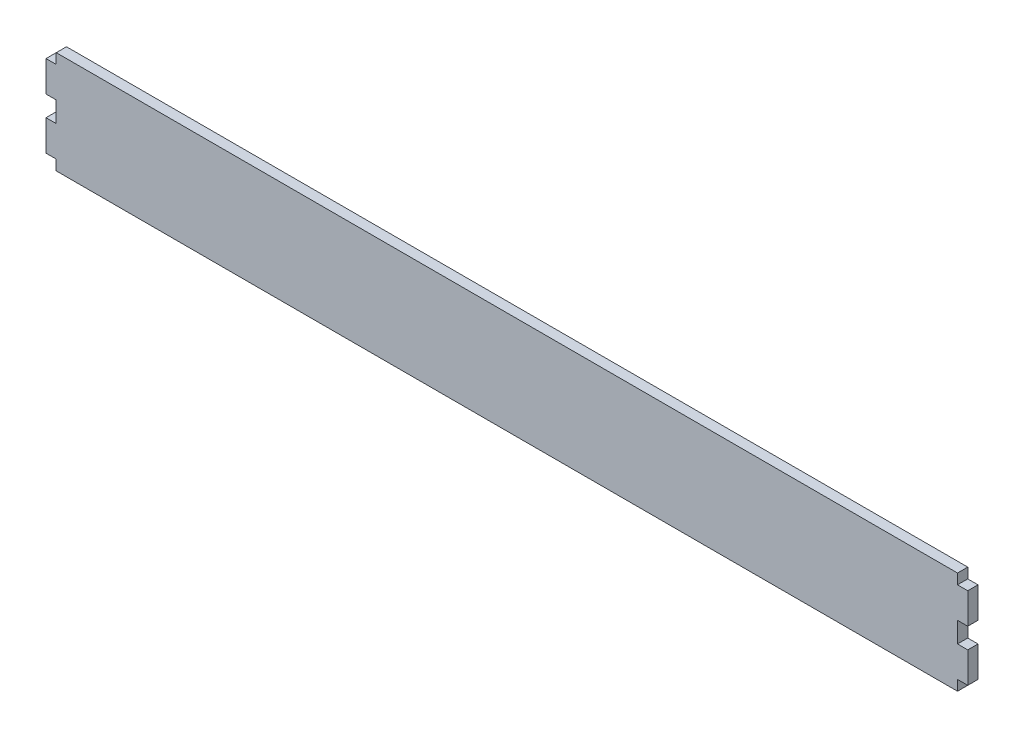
ISO-10303-21;
HEADER;
FILE_DESCRIPTION(('STEP AP214'),'2;1');
FILE_NAME('part.step','',(''),(''),'','','');
FILE_SCHEMA(('AUTOMOTIVE_DESIGN { 1 0 10303 214 1 1 1 1 }'));
ENDSEC;
DATA;
#1=APPLICATION_CONTEXT('core data for automotive mechanical design processes');
#2=APPLICATION_PROTOCOL_DEFINITION('international standard','automotive_design',2000,#1);
#3=PRODUCT_CONTEXT('',#1,'mechanical');
#4=PRODUCT('Part','Part','',(#3));
#5=PRODUCT_RELATED_PRODUCT_CATEGORY('part','',(#4));
#6=PRODUCT_DEFINITION_FORMATION('','',#4);
#7=PRODUCT_DEFINITION_CONTEXT('part definition',#1,'design');
#8=PRODUCT_DEFINITION('design','',#6,#7);
#9=PRODUCT_DEFINITION_SHAPE('','',#8);
#10=(LENGTH_UNIT() NAMED_UNIT(*) SI_UNIT(.MILLI.,.METRE.));
#11=(NAMED_UNIT(*) PLANE_ANGLE_UNIT() SI_UNIT($,.RADIAN.));
#12=(NAMED_UNIT(*) SI_UNIT($,.STERADIAN.) SOLID_ANGLE_UNIT());
#13=UNCERTAINTY_MEASURE_WITH_UNIT(LENGTH_MEASURE(1.E-05),#10,'distance_accuracy_value','');
#14=(GEOMETRIC_REPRESENTATION_CONTEXT(3) GLOBAL_UNCERTAINTY_ASSIGNED_CONTEXT((#13)) GLOBAL_UNIT_ASSIGNED_CONTEXT((#10,
#11,#12)) REPRESENTATION_CONTEXT('',''));
#15=CARTESIAN_POINT('',(0.,0.,0.));
#16=DIRECTION('',(0.,0.,1.));
#17=DIRECTION('',(1.,0.,0.));
#18=AXIS2_PLACEMENT_3D('',#15,#16,#17);
#19=CARTESIAN_POINT('',(220.,20.,5.));
#20=DIRECTION('',(-1.,0.,0.));
#21=DIRECTION('',(0.,0.,1.));
#22=AXIS2_PLACEMENT_3D('',#19,#20,#21);
#23=PLANE('',#22);
#24=DIRECTION('',(0.,1.,0.));
#25=VECTOR('',#24,1.);
#26=CARTESIAN_POINT('',(220.,20.,0.));
#27=LINE('',#26,#25);
#28=CARTESIAN_POINT('',(220.,20.,0.));
#29=VERTEX_POINT('',#28);
#30=CARTESIAN_POINT('',(220.,25.,0.));
#31=VERTEX_POINT('',#30);
#32=EDGE_CURVE('E216',#29,#31,#27,.T.);
#33=ORIENTED_EDGE('',*,*,#32,.T.);
#34=DIRECTION('',(0.,0.,-1.));
#35=VECTOR('',#34,1.);
#36=CARTESIAN_POINT('',(220.,25.,5.));
#37=LINE('',#36,#35);
#38=CARTESIAN_POINT('',(220.,25.,5.));
#39=VERTEX_POINT('',#38);
#40=EDGE_CURVE('E11',#39,#31,#37,.T.);
#41=ORIENTED_EDGE('',*,*,#40,.F.);
#42=DIRECTION('',(0.,1.,0.));
#43=VECTOR('',#42,1.);
#44=CARTESIAN_POINT('',(220.,20.,5.));
#45=LINE('',#44,#43);
#46=CARTESIAN_POINT('',(220.,20.,5.));
#47=VERTEX_POINT('',#46);
#48=EDGE_CURVE('E274',#47,#39,#45,.T.);
#49=ORIENTED_EDGE('',*,*,#48,.F.);
#50=DIRECTION('',(0.,0.,-1.));
#51=VECTOR('',#50,1.);
#52=CARTESIAN_POINT('',(220.,20.,5.));
#53=LINE('',#52,#51);
#54=EDGE_CURVE('E212',#47,#29,#53,.T.);
#55=ORIENTED_EDGE('',*,*,#54,.T.);
#56=EDGE_LOOP('',(#33,#41,#49,#55));
#57=FACE_BOUND('',#56,.T.);
#58=ADVANCED_FACE('F43',(#57),#23,.F.);
#59=CARTESIAN_POINT('',(220.,25.,5.));
#60=DIRECTION('',(0.,-1.,0.));
#61=DIRECTION('',(0.,0.,-1.));
#62=AXIS2_PLACEMENT_3D('',#59,#60,#61);
#63=PLANE('',#62);
#64=DIRECTION('',(-1.,0.,0.));
#65=VECTOR('',#64,1.);
#66=CARTESIAN_POINT('',(220.,25.,0.));
#67=LINE('',#66,#65);
#68=CARTESIAN_POINT('',(-220.,25.,0.));
#69=VERTEX_POINT('',#68);
#70=EDGE_CURVE('E220',#31,#69,#67,.T.);
#71=ORIENTED_EDGE('',*,*,#70,.T.);
#72=DIRECTION('',(0.,0.,-1.));
#73=VECTOR('',#72,1.);
#74=CARTESIAN_POINT('',(-220.,25.,5.));
#75=LINE('',#74,#73);
#76=CARTESIAN_POINT('',(-220.,25.,5.));
#77=VERTEX_POINT('',#76);
#78=EDGE_CURVE('E52',#77,#69,#75,.T.);
#79=ORIENTED_EDGE('',*,*,#78,.F.);
#80=DIRECTION('',(-1.,0.,0.));
#81=VECTOR('',#80,1.);
#82=CARTESIAN_POINT('',(220.,25.,5.));
#83=LINE('',#82,#81);
#84=EDGE_CURVE('E139',#39,#77,#83,.T.);
#85=ORIENTED_EDGE('',*,*,#84,.F.);
#86=ORIENTED_EDGE('',*,*,#40,.T.);
#87=EDGE_LOOP('',(#71,#79,#85,#86));
#88=FACE_BOUND('',#87,.T.);
#89=ADVANCED_FACE('F424',(#88),#63,.F.);
#90=CARTESIAN_POINT('',(-220.,25.,5.));
#91=DIRECTION('',(1.,0.,0.));
#92=DIRECTION('',(0.,0.,-1.));
#93=AXIS2_PLACEMENT_3D('',#90,#91,#92);
#94=PLANE('',#93);
#95=DIRECTION('',(0.,-1.,0.));
#96=VECTOR('',#95,1.);
#97=CARTESIAN_POINT('',(-220.,25.,0.));
#98=LINE('',#97,#96);
#99=CARTESIAN_POINT('',(-220.,20.,0.));
#100=VERTEX_POINT('',#99);
#101=EDGE_CURVE('E223',#69,#100,#98,.T.);
#102=ORIENTED_EDGE('',*,*,#101,.T.);
#103=DIRECTION('',(0.,0.,-1.));
#104=VECTOR('',#103,1.);
#105=CARTESIAN_POINT('',(-220.,20.,5.));
#106=LINE('',#105,#104);
#107=CARTESIAN_POINT('',(-220.,20.,5.));
#108=VERTEX_POINT('',#107);
#109=EDGE_CURVE('E333',#108,#100,#106,.T.);
#110=ORIENTED_EDGE('',*,*,#109,.F.);
#111=DIRECTION('',(0.,-1.,0.));
#112=VECTOR('',#111,1.);
#113=CARTESIAN_POINT('',(-220.,25.,5.));
#114=LINE('',#113,#112);
#115=EDGE_CURVE('E343',#77,#108,#114,.T.);
#116=ORIENTED_EDGE('',*,*,#115,.F.);
#117=ORIENTED_EDGE('',*,*,#78,.T.);
#118=EDGE_LOOP('',(#102,#110,#116,#117));
#119=FACE_BOUND('',#118,.T.);
#120=ADVANCED_FACE('F341',(#119),#94,.F.);
#121=CARTESIAN_POINT('',(-220.,20.,5.));
#122=DIRECTION('',(0.,-1.,0.));
#123=DIRECTION('',(0.,0.,-1.));
#124=AXIS2_PLACEMENT_3D('',#121,#122,#123);
#125=PLANE('',#124);
#126=DIRECTION('',(-1.,0.,0.));
#127=VECTOR('',#126,1.);
#128=CARTESIAN_POINT('',(-220.,20.,0.));
#129=LINE('',#128,#127);
#130=CARTESIAN_POINT('',(-225.,20.,0.));
#131=VERTEX_POINT('',#130);
#132=EDGE_CURVE('E226',#100,#131,#129,.T.);
#133=ORIENTED_EDGE('',*,*,#132,.T.);
#134=DIRECTION('',(0.,0.,-1.));
#135=VECTOR('',#134,1.);
#136=CARTESIAN_POINT('',(-225.,20.,5.));
#137=LINE('',#136,#135);
#138=CARTESIAN_POINT('',(-225.,20.,5.));
#139=VERTEX_POINT('',#138);
#140=EDGE_CURVE('E329',#139,#131,#137,.T.);
#141=ORIENTED_EDGE('',*,*,#140,.F.);
#142=DIRECTION('',(-1.,0.,0.));
#143=VECTOR('',#142,1.);
#144=CARTESIAN_POINT('',(-220.,20.,5.));
#145=LINE('',#144,#143);
#146=EDGE_CURVE('E362',#108,#139,#145,.T.);
#147=ORIENTED_EDGE('',*,*,#146,.F.);
#148=ORIENTED_EDGE('',*,*,#109,.T.);
#149=EDGE_LOOP('',(#133,#141,#147,#148));
#150=FACE_BOUND('',#149,.T.);
#151=ADVANCED_FACE('F352',(#150),#125,.F.);
#152=CARTESIAN_POINT('',(-225.,20.,5.));
#153=DIRECTION('',(1.,0.,0.));
#154=DIRECTION('',(0.,0.,-1.));
#155=AXIS2_PLACEMENT_3D('',#152,#153,#154);
#156=PLANE('',#155);
#157=DIRECTION('',(0.,-1.,0.));
#158=VECTOR('',#157,1.);
#159=CARTESIAN_POINT('',(-225.,20.,0.));
#160=LINE('',#159,#158);
#161=CARTESIAN_POINT('',(-225.,5.,0.));
#162=VERTEX_POINT('',#161);
#163=EDGE_CURVE('E229',#131,#162,#160,.T.);
#164=ORIENTED_EDGE('',*,*,#163,.T.);
#165=DIRECTION('',(0.,0.,-1.));
#166=VECTOR('',#165,1.);
#167=CARTESIAN_POINT('',(-225.,5.,5.));
#168=LINE('',#167,#166);
#169=CARTESIAN_POINT('',(-225.,5.,5.));
#170=VERTEX_POINT('',#169);
#171=EDGE_CURVE('E325',#170,#162,#168,.T.);
#172=ORIENTED_EDGE('',*,*,#171,.F.);
#173=DIRECTION('',(0.,-1.,0.));
#174=VECTOR('',#173,1.);
#175=CARTESIAN_POINT('',(-225.,20.,5.));
#176=LINE('',#175,#174);
#177=EDGE_CURVE('E358',#139,#170,#176,.T.);
#178=ORIENTED_EDGE('',*,*,#177,.F.);
#179=ORIENTED_EDGE('',*,*,#140,.T.);
#180=EDGE_LOOP('',(#164,#172,#178,#179));
#181=FACE_BOUND('',#180,.T.);
#182=ADVANCED_FACE('F356',(#181),#156,.F.);
#183=CARTESIAN_POINT('',(-225.,5.,5.));
#184=DIRECTION('',(0.,1.,0.));
#185=DIRECTION('',(0.,0.,1.));
#186=AXIS2_PLACEMENT_3D('',#183,#184,#185);
#187=PLANE('',#186);
#188=DIRECTION('',(1.,0.,0.));
#189=VECTOR('',#188,1.);
#190=CARTESIAN_POINT('',(-225.,5.,0.));
#191=LINE('',#190,#189);
#192=CARTESIAN_POINT('',(-220.,5.,0.));
#193=VERTEX_POINT('',#192);
#194=EDGE_CURVE('E232',#162,#193,#191,.T.);
#195=ORIENTED_EDGE('',*,*,#194,.T.);
#196=DIRECTION('',(0.,0.,-1.));
#197=VECTOR('',#196,1.);
#198=CARTESIAN_POINT('',(-220.,5.,5.));
#199=LINE('',#198,#197);
#200=CARTESIAN_POINT('',(-220.,5.,5.));
#201=VERTEX_POINT('',#200);
#202=EDGE_CURVE('E321',#201,#193,#199,.T.);
#203=ORIENTED_EDGE('',*,*,#202,.F.);
#204=DIRECTION('',(1.,0.,0.));
#205=VECTOR('',#204,1.);
#206=CARTESIAN_POINT('',(-225.,5.,5.));
#207=LINE('',#206,#205);
#208=EDGE_CURVE('E361',#170,#201,#207,.T.);
#209=ORIENTED_EDGE('',*,*,#208,.F.);
#210=ORIENTED_EDGE('',*,*,#171,.T.);
#211=EDGE_LOOP('',(#195,#203,#209,#210));
#212=FACE_BOUND('',#211,.T.);
#213=ADVANCED_FACE('F437',(#212),#187,.F.);
#214=CARTESIAN_POINT('',(-220.,5.,5.));
#215=DIRECTION('',(1.,0.,0.));
#216=DIRECTION('',(0.,0.,-1.));
#217=AXIS2_PLACEMENT_3D('',#214,#215,#216);
#218=PLANE('',#217);
#219=DIRECTION('',(0.,-1.,0.));
#220=VECTOR('',#219,1.);
#221=CARTESIAN_POINT('',(-220.,5.,0.));
#222=LINE('',#221,#220);
#223=CARTESIAN_POINT('',(-220.,-5.,0.));
#224=VERTEX_POINT('',#223);
#225=EDGE_CURVE('E235',#193,#224,#222,.T.);
#226=ORIENTED_EDGE('',*,*,#225,.T.);
#227=DIRECTION('',(0.,0.,-1.));
#228=VECTOR('',#227,1.);
#229=CARTESIAN_POINT('',(-220.,-5.,5.));
#230=LINE('',#229,#228);
#231=CARTESIAN_POINT('',(-220.,-5.,5.));
#232=VERTEX_POINT('',#231);
#233=EDGE_CURVE('E317',#232,#224,#230,.T.);
#234=ORIENTED_EDGE('',*,*,#233,.F.);
#235=DIRECTION('',(0.,-1.,0.));
#236=VECTOR('',#235,1.);
#237=CARTESIAN_POINT('',(-220.,5.,5.));
#238=LINE('',#237,#236);
#239=EDGE_CURVE('E366',#201,#232,#238,.T.);
#240=ORIENTED_EDGE('',*,*,#239,.F.);
#241=ORIENTED_EDGE('',*,*,#202,.T.);
#242=EDGE_LOOP('',(#226,#234,#240,#241));
#243=FACE_BOUND('',#242,.T.);
#244=ADVANCED_FACE('F440',(#243),#218,.F.);
#245=CARTESIAN_POINT('',(-220.,-5.,5.));
#246=DIRECTION('',(0.,-1.,0.));
#247=DIRECTION('',(0.,0.,-1.));
#248=AXIS2_PLACEMENT_3D('',#245,#246,#247);
#249=PLANE('',#248);
#250=DIRECTION('',(-1.,0.,0.));
#251=VECTOR('',#250,1.);
#252=CARTESIAN_POINT('',(-220.,-5.,0.));
#253=LINE('',#252,#251);
#254=CARTESIAN_POINT('',(-225.,-5.,0.));
#255=VERTEX_POINT('',#254);
#256=EDGE_CURVE('E238',#224,#255,#253,.T.);
#257=ORIENTED_EDGE('',*,*,#256,.T.);
#258=DIRECTION('',(0.,0.,-1.));
#259=VECTOR('',#258,1.);
#260=CARTESIAN_POINT('',(-225.,-5.,5.));
#261=LINE('',#260,#259);
#262=CARTESIAN_POINT('',(-225.,-5.,5.));
#263=VERTEX_POINT('',#262);
#264=EDGE_CURVE('E313',#263,#255,#261,.T.);
#265=ORIENTED_EDGE('',*,*,#264,.F.);
#266=DIRECTION('',(-1.,0.,0.));
#267=VECTOR('',#266,1.);
#268=CARTESIAN_POINT('',(-220.,-5.,5.));
#269=LINE('',#268,#267);
#270=EDGE_CURVE('E373',#232,#263,#269,.T.);
#271=ORIENTED_EDGE('',*,*,#270,.F.);
#272=ORIENTED_EDGE('',*,*,#233,.T.);
#273=EDGE_LOOP('',(#257,#265,#271,#272));
#274=FACE_BOUND('',#273,.T.);
#275=ADVANCED_FACE('F444',(#274),#249,.F.);
#276=CARTESIAN_POINT('',(-225.,-5.,5.));
#277=DIRECTION('',(1.,0.,0.));
#278=DIRECTION('',(0.,0.,-1.));
#279=AXIS2_PLACEMENT_3D('',#276,#277,#278);
#280=PLANE('',#279);
#281=DIRECTION('',(0.,-1.,0.));
#282=VECTOR('',#281,1.);
#283=CARTESIAN_POINT('',(-225.,-5.,0.));
#284=LINE('',#283,#282);
#285=CARTESIAN_POINT('',(-225.,-20.,0.));
#286=VERTEX_POINT('',#285);
#287=EDGE_CURVE('E241',#255,#286,#284,.T.);
#288=ORIENTED_EDGE('',*,*,#287,.T.);
#289=DIRECTION('',(0.,0.,-1.));
#290=VECTOR('',#289,1.);
#291=CARTESIAN_POINT('',(-225.,-20.,5.));
#292=LINE('',#291,#290);
#293=CARTESIAN_POINT('',(-225.,-20.,5.));
#294=VERTEX_POINT('',#293);
#295=EDGE_CURVE('E309',#294,#286,#292,.T.);
#296=ORIENTED_EDGE('',*,*,#295,.F.);
#297=DIRECTION('',(0.,-1.,0.));
#298=VECTOR('',#297,1.);
#299=CARTESIAN_POINT('',(-225.,-5.,5.));
#300=LINE('',#299,#298);
#301=EDGE_CURVE('E376',#263,#294,#300,.T.);
#302=ORIENTED_EDGE('',*,*,#301,.F.);
#303=ORIENTED_EDGE('',*,*,#264,.T.);
#304=EDGE_LOOP('',(#288,#296,#302,#303));
#305=FACE_BOUND('',#304,.T.);
#306=ADVANCED_FACE('F448',(#305),#280,.F.);
#307=CARTESIAN_POINT('',(-225.,-20.,5.));
#308=DIRECTION('',(0.,1.,0.));
#309=DIRECTION('',(0.,0.,1.));
#310=AXIS2_PLACEMENT_3D('',#307,#308,#309);
#311=PLANE('',#310);
#312=DIRECTION('',(1.,0.,0.));
#313=VECTOR('',#312,1.);
#314=CARTESIAN_POINT('',(-225.,-20.,0.));
#315=LINE('',#314,#313);
#316=CARTESIAN_POINT('',(-220.,-20.,0.));
#317=VERTEX_POINT('',#316);
#318=EDGE_CURVE('E244',#286,#317,#315,.T.);
#319=ORIENTED_EDGE('',*,*,#318,.T.);
#320=DIRECTION('',(0.,0.,-1.));
#321=VECTOR('',#320,1.);
#322=CARTESIAN_POINT('',(-220.,-20.,5.));
#323=LINE('',#322,#321);
#324=CARTESIAN_POINT('',(-220.,-20.,5.));
#325=VERTEX_POINT('',#324);
#326=EDGE_CURVE('E305',#325,#317,#323,.T.);
#327=ORIENTED_EDGE('',*,*,#326,.F.);
#328=DIRECTION('',(1.,0.,0.));
#329=VECTOR('',#328,1.);
#330=CARTESIAN_POINT('',(-225.,-20.,5.));
#331=LINE('',#330,#329);
#332=EDGE_CURVE('E379',#294,#325,#331,.T.);
#333=ORIENTED_EDGE('',*,*,#332,.F.);
#334=ORIENTED_EDGE('',*,*,#295,.T.);
#335=EDGE_LOOP('',(#319,#327,#333,#334));
#336=FACE_BOUND('',#335,.T.);
#337=ADVANCED_FACE('F452',(#336),#311,.F.);
#338=CARTESIAN_POINT('',(-220.,-20.,5.));
#339=DIRECTION('',(1.,0.,0.));
#340=DIRECTION('',(0.,0.,-1.));
#341=AXIS2_PLACEMENT_3D('',#338,#339,#340);
#342=PLANE('',#341);
#343=DIRECTION('',(0.,-1.,0.));
#344=VECTOR('',#343,1.);
#345=CARTESIAN_POINT('',(-220.,-20.,0.));
#346=LINE('',#345,#344);
#347=CARTESIAN_POINT('',(-220.,-25.,0.));
#348=VERTEX_POINT('',#347);
#349=EDGE_CURVE('E247',#317,#348,#346,.T.);
#350=ORIENTED_EDGE('',*,*,#349,.T.);
#351=DIRECTION('',(0.,0.,-1.));
#352=VECTOR('',#351,1.);
#353=CARTESIAN_POINT('',(-220.,-25.,5.));
#354=LINE('',#353,#352);
#355=CARTESIAN_POINT('',(-220.,-25.,5.));
#356=VERTEX_POINT('',#355);
#357=EDGE_CURVE('E301',#356,#348,#354,.T.);
#358=ORIENTED_EDGE('',*,*,#357,.F.);
#359=DIRECTION('',(0.,-1.,0.));
#360=VECTOR('',#359,1.);
#361=CARTESIAN_POINT('',(-220.,-20.,5.));
#362=LINE('',#361,#360);
#363=EDGE_CURVE('E382',#325,#356,#362,.T.);
#364=ORIENTED_EDGE('',*,*,#363,.F.);
#365=ORIENTED_EDGE('',*,*,#326,.T.);
#366=EDGE_LOOP('',(#350,#358,#364,#365));
#367=FACE_BOUND('',#366,.T.);
#368=ADVANCED_FACE('F456',(#367),#342,.F.);
#369=CARTESIAN_POINT('',(-220.,-25.,5.));
#370=DIRECTION('',(0.,1.,0.));
#371=DIRECTION('',(0.,0.,1.));
#372=AXIS2_PLACEMENT_3D('',#369,#370,#371);
#373=PLANE('',#372);
#374=DIRECTION('',(1.,0.,0.));
#375=VECTOR('',#374,1.);
#376=CARTESIAN_POINT('',(-220.,-25.,0.));
#377=LINE('',#376,#375);
#378=CARTESIAN_POINT('',(220.,-25.,0.));
#379=VERTEX_POINT('',#378);
#380=EDGE_CURVE('E250',#348,#379,#377,.T.);
#381=ORIENTED_EDGE('',*,*,#380,.T.);
#382=DIRECTION('',(0.,0.,-1.));
#383=VECTOR('',#382,1.);
#384=CARTESIAN_POINT('',(220.,-25.,5.));
#385=LINE('',#384,#383);
#386=CARTESIAN_POINT('',(220.,-25.,5.));
#387=VERTEX_POINT('',#386);
#388=EDGE_CURVE('E297',#387,#379,#385,.T.);
#389=ORIENTED_EDGE('',*,*,#388,.F.);
#390=DIRECTION('',(1.,0.,0.));
#391=VECTOR('',#390,1.);
#392=CARTESIAN_POINT('',(-220.,-25.,5.));
#393=LINE('',#392,#391);
#394=EDGE_CURVE('E385',#356,#387,#393,.T.);
#395=ORIENTED_EDGE('',*,*,#394,.F.);
#396=ORIENTED_EDGE('',*,*,#357,.T.);
#397=EDGE_LOOP('',(#381,#389,#395,#396));
#398=FACE_BOUND('',#397,.T.);
#399=ADVANCED_FACE('F460',(#398),#373,.F.);
#400=CARTESIAN_POINT('',(220.,-25.,5.));
#401=DIRECTION('',(-1.,0.,0.));
#402=DIRECTION('',(0.,0.,1.));
#403=AXIS2_PLACEMENT_3D('',#400,#401,#402);
#404=PLANE('',#403);
#405=DIRECTION('',(0.,1.,0.));
#406=VECTOR('',#405,1.);
#407=CARTESIAN_POINT('',(220.,-25.,0.));
#408=LINE('',#407,#406);
#409=CARTESIAN_POINT('',(220.,-20.,0.));
#410=VERTEX_POINT('',#409);
#411=EDGE_CURVE('E253',#379,#410,#408,.T.);
#412=ORIENTED_EDGE('',*,*,#411,.T.);
#413=DIRECTION('',(0.,0.,-1.));
#414=VECTOR('',#413,1.);
#415=CARTESIAN_POINT('',(220.,-20.,5.));
#416=LINE('',#415,#414);
#417=CARTESIAN_POINT('',(220.,-20.,5.));
#418=VERTEX_POINT('',#417);
#419=EDGE_CURVE('E293',#418,#410,#416,.T.);
#420=ORIENTED_EDGE('',*,*,#419,.F.);
#421=DIRECTION('',(0.,1.,0.));
#422=VECTOR('',#421,1.);
#423=CARTESIAN_POINT('',(220.,-25.,5.));
#424=LINE('',#423,#422);
#425=EDGE_CURVE('E388',#387,#418,#424,.T.);
#426=ORIENTED_EDGE('',*,*,#425,.F.);
#427=ORIENTED_EDGE('',*,*,#388,.T.);
#428=EDGE_LOOP('',(#412,#420,#426,#427));
#429=FACE_BOUND('',#428,.T.);
#430=ADVANCED_FACE('F464',(#429),#404,.F.);
#431=CARTESIAN_POINT('',(220.,-20.,5.));
#432=DIRECTION('',(0.,1.,0.));
#433=DIRECTION('',(0.,0.,1.));
#434=AXIS2_PLACEMENT_3D('',#431,#432,#433);
#435=PLANE('',#434);
#436=DIRECTION('',(1.,0.,0.));
#437=VECTOR('',#436,1.);
#438=CARTESIAN_POINT('',(220.,-20.,0.));
#439=LINE('',#438,#437);
#440=CARTESIAN_POINT('',(225.,-20.,0.));
#441=VERTEX_POINT('',#440);
#442=EDGE_CURVE('E256',#410,#441,#439,.T.);
#443=ORIENTED_EDGE('',*,*,#442,.T.);
#444=DIRECTION('',(0.,0.,-1.));
#445=VECTOR('',#444,1.);
#446=CARTESIAN_POINT('',(225.,-20.,5.));
#447=LINE('',#446,#445);
#448=CARTESIAN_POINT('',(225.,-20.,5.));
#449=VERTEX_POINT('',#448);
#450=EDGE_CURVE('E289',#449,#441,#447,.T.);
#451=ORIENTED_EDGE('',*,*,#450,.F.);
#452=DIRECTION('',(1.,0.,0.));
#453=VECTOR('',#452,1.);
#454=CARTESIAN_POINT('',(220.,-20.,5.));
#455=LINE('',#454,#453);
#456=EDGE_CURVE('E391',#418,#449,#455,.T.);
#457=ORIENTED_EDGE('',*,*,#456,.F.);
#458=ORIENTED_EDGE('',*,*,#419,.T.);
#459=EDGE_LOOP('',(#443,#451,#457,#458));
#460=FACE_BOUND('',#459,.T.);
#461=ADVANCED_FACE('F468',(#460),#435,.F.);
#462=CARTESIAN_POINT('',(225.,-20.,5.));
#463=DIRECTION('',(-1.,0.,0.));
#464=DIRECTION('',(0.,0.,1.));
#465=AXIS2_PLACEMENT_3D('',#462,#463,#464);
#466=PLANE('',#465);
#467=DIRECTION('',(0.,1.,0.));
#468=VECTOR('',#467,1.);
#469=CARTESIAN_POINT('',(225.,-20.,0.));
#470=LINE('',#469,#468);
#471=CARTESIAN_POINT('',(225.,-5.,0.));
#472=VERTEX_POINT('',#471);
#473=EDGE_CURVE('E259',#441,#472,#470,.T.);
#474=ORIENTED_EDGE('',*,*,#473,.T.);
#475=DIRECTION('',(0.,0.,-1.));
#476=VECTOR('',#475,1.);
#477=CARTESIAN_POINT('',(225.,-5.,5.));
#478=LINE('',#477,#476);
#479=CARTESIAN_POINT('',(225.,-5.,5.));
#480=VERTEX_POINT('',#479);
#481=EDGE_CURVE('E285',#480,#472,#478,.T.);
#482=ORIENTED_EDGE('',*,*,#481,.F.);
#483=DIRECTION('',(0.,1.,0.));
#484=VECTOR('',#483,1.);
#485=CARTESIAN_POINT('',(225.,-20.,5.));
#486=LINE('',#485,#484);
#487=EDGE_CURVE('E394',#449,#480,#486,.T.);
#488=ORIENTED_EDGE('',*,*,#487,.F.);
#489=ORIENTED_EDGE('',*,*,#450,.T.);
#490=EDGE_LOOP('',(#474,#482,#488,#489));
#491=FACE_BOUND('',#490,.T.);
#492=ADVANCED_FACE('F472',(#491),#466,.F.);
#493=CARTESIAN_POINT('',(225.,-5.,5.));
#494=DIRECTION('',(0.,-1.,0.));
#495=DIRECTION('',(0.,0.,-1.));
#496=AXIS2_PLACEMENT_3D('',#493,#494,#495);
#497=PLANE('',#496);
#498=DIRECTION('',(-1.,0.,0.));
#499=VECTOR('',#498,1.);
#500=CARTESIAN_POINT('',(225.,-5.,0.));
#501=LINE('',#500,#499);
#502=CARTESIAN_POINT('',(220.,-5.,0.));
#503=VERTEX_POINT('',#502);
#504=EDGE_CURVE('E262',#472,#503,#501,.T.);
#505=ORIENTED_EDGE('',*,*,#504,.T.);
#506=DIRECTION('',(0.,0.,-1.));
#507=VECTOR('',#506,1.);
#508=CARTESIAN_POINT('',(220.,-5.,5.));
#509=LINE('',#508,#507);
#510=CARTESIAN_POINT('',(220.,-5.,5.));
#511=VERTEX_POINT('',#510);
#512=EDGE_CURVE('E281',#511,#503,#509,.T.);
#513=ORIENTED_EDGE('',*,*,#512,.F.);
#514=DIRECTION('',(-1.,0.,0.));
#515=VECTOR('',#514,1.);
#516=CARTESIAN_POINT('',(225.,-5.,5.));
#517=LINE('',#516,#515);
#518=EDGE_CURVE('E397',#480,#511,#517,.T.);
#519=ORIENTED_EDGE('',*,*,#518,.F.);
#520=ORIENTED_EDGE('',*,*,#481,.T.);
#521=EDGE_LOOP('',(#505,#513,#519,#520));
#522=FACE_BOUND('',#521,.T.);
#523=ADVANCED_FACE('F405',(#522),#497,.F.);
#524=CARTESIAN_POINT('',(220.,-5.,5.));
#525=DIRECTION('',(-1.,0.,0.));
#526=DIRECTION('',(0.,0.,1.));
#527=AXIS2_PLACEMENT_3D('',#524,#525,#526);
#528=PLANE('',#527);
#529=DIRECTION('',(0.,1.,0.));
#530=VECTOR('',#529,1.);
#531=CARTESIAN_POINT('',(220.,-5.,0.));
#532=LINE('',#531,#530);
#533=CARTESIAN_POINT('',(220.,5.,0.));
#534=VERTEX_POINT('',#533);
#535=EDGE_CURVE('E265',#503,#534,#532,.T.);
#536=ORIENTED_EDGE('',*,*,#535,.T.);
#537=DIRECTION('',(0.,0.,-1.));
#538=VECTOR('',#537,1.);
#539=CARTESIAN_POINT('',(220.,5.,5.));
#540=LINE('',#539,#538);
#541=CARTESIAN_POINT('',(220.,5.,5.));
#542=VERTEX_POINT('',#541);
#543=EDGE_CURVE('E205',#542,#534,#540,.T.);
#544=ORIENTED_EDGE('',*,*,#543,.F.);
#545=DIRECTION('',(0.,1.,0.));
#546=VECTOR('',#545,1.);
#547=CARTESIAN_POINT('',(220.,-5.,5.));
#548=LINE('',#547,#546);
#549=EDGE_CURVE('E194',#511,#542,#548,.T.);
#550=ORIENTED_EDGE('',*,*,#549,.F.);
#551=ORIENTED_EDGE('',*,*,#512,.T.);
#552=EDGE_LOOP('',(#536,#544,#550,#551));
#553=FACE_BOUND('',#552,.T.);
#554=ADVANCED_FACE('F409',(#553),#528,.F.);
#555=CARTESIAN_POINT('',(220.,5.,5.));
#556=DIRECTION('',(0.,1.,0.));
#557=DIRECTION('',(0.,0.,1.));
#558=AXIS2_PLACEMENT_3D('',#555,#556,#557);
#559=PLANE('',#558);
#560=DIRECTION('',(1.,0.,0.));
#561=VECTOR('',#560,1.);
#562=CARTESIAN_POINT('',(220.,5.,0.));
#563=LINE('',#562,#561);
#564=CARTESIAN_POINT('',(225.,5.,0.));
#565=VERTEX_POINT('',#564);
#566=EDGE_CURVE('E203',#534,#565,#563,.T.);
#567=ORIENTED_EDGE('',*,*,#566,.T.);
#568=DIRECTION('',(0.,0.,-1.));
#569=VECTOR('',#568,1.);
#570=CARTESIAN_POINT('',(225.,5.,5.));
#571=LINE('',#570,#569);
#572=CARTESIAN_POINT('',(225.,5.,5.));
#573=VERTEX_POINT('',#572);
#574=EDGE_CURVE('E200',#573,#565,#571,.T.);
#575=ORIENTED_EDGE('',*,*,#574,.F.);
#576=DIRECTION('',(1.,0.,0.));
#577=VECTOR('',#576,1.);
#578=CARTESIAN_POINT('',(220.,5.,5.));
#579=LINE('',#578,#577);
#580=EDGE_CURVE('E188',#542,#573,#579,.T.);
#581=ORIENTED_EDGE('',*,*,#580,.F.);
#582=ORIENTED_EDGE('',*,*,#543,.T.);
#583=EDGE_LOOP('',(#567,#575,#581,#582));
#584=FACE_BOUND('',#583,.T.);
#585=ADVANCED_FACE('F201',(#584),#559,.F.);
#586=CARTESIAN_POINT('',(225.,5.,5.));
#587=DIRECTION('',(-1.,0.,0.));
#588=DIRECTION('',(0.,0.,1.));
#589=AXIS2_PLACEMENT_3D('',#586,#587,#588);
#590=PLANE('',#589);
#591=DIRECTION('',(0.,1.,0.));
#592=VECTOR('',#591,1.);
#593=CARTESIAN_POINT('',(225.,5.,0.));
#594=LINE('',#593,#592);
#595=CARTESIAN_POINT('',(225.,20.,0.));
#596=VERTEX_POINT('',#595);
#597=EDGE_CURVE('E125',#565,#596,#594,.T.);
#598=ORIENTED_EDGE('',*,*,#597,.T.);
#599=DIRECTION('',(0.,0.,-1.));
#600=VECTOR('',#599,1.);
#601=CARTESIAN_POINT('',(225.,20.,5.));
#602=LINE('',#601,#600);
#603=CARTESIAN_POINT('',(225.,20.,5.));
#604=VERTEX_POINT('',#603);
#605=EDGE_CURVE('E206',#604,#596,#602,.T.);
#606=ORIENTED_EDGE('',*,*,#605,.F.);
#607=DIRECTION('',(0.,1.,0.));
#608=VECTOR('',#607,1.);
#609=CARTESIAN_POINT('',(225.,5.,5.));
#610=LINE('',#609,#608);
#611=EDGE_CURVE('E192',#573,#604,#610,.T.);
#612=ORIENTED_EDGE('',*,*,#611,.F.);
#613=ORIENTED_EDGE('',*,*,#574,.T.);
#614=EDGE_LOOP('',(#598,#606,#612,#613));
#615=FACE_BOUND('',#614,.T.);
#616=ADVANCED_FACE('F208',(#615),#590,.F.);
#617=CARTESIAN_POINT('',(225.,20.,5.));
#618=DIRECTION('',(0.,-1.,0.));
#619=DIRECTION('',(0.,0.,-1.));
#620=AXIS2_PLACEMENT_3D('',#617,#618,#619);
#621=PLANE('',#620);
#622=DIRECTION('',(-1.,0.,0.));
#623=VECTOR('',#622,1.);
#624=CARTESIAN_POINT('',(225.,20.,0.));
#625=LINE('',#624,#623);
#626=EDGE_CURVE('E131',#596,#29,#625,.T.);
#627=ORIENTED_EDGE('',*,*,#626,.T.);
#628=ORIENTED_EDGE('',*,*,#54,.F.);
#629=DIRECTION('',(-1.,0.,0.));
#630=VECTOR('',#629,1.);
#631=CARTESIAN_POINT('',(225.,20.,5.));
#632=LINE('',#631,#630);
#633=EDGE_CURVE('E60',#604,#47,#632,.T.);
#634=ORIENTED_EDGE('',*,*,#633,.F.);
#635=ORIENTED_EDGE('',*,*,#605,.T.);
#636=EDGE_LOOP('',(#627,#628,#634,#635));
#637=FACE_BOUND('',#636,.T.);
#638=ADVANCED_FACE('F413',(#637),#621,.F.);
#639=CARTESIAN_POINT('',(0.,0.,5.));
#640=DIRECTION('',(0.,0.,1.));
#641=DIRECTION('',(1.,0.,0.));
#642=AXIS2_PLACEMENT_3D('',#639,#640,#641);
#643=PLANE('',#642);
#644=ORIENTED_EDGE('',*,*,#48,.T.);
#645=ORIENTED_EDGE('',*,*,#84,.T.);
#646=ORIENTED_EDGE('',*,*,#115,.T.);
#647=ORIENTED_EDGE('',*,*,#146,.T.);
#648=ORIENTED_EDGE('',*,*,#177,.T.);
#649=ORIENTED_EDGE('',*,*,#208,.T.);
#650=ORIENTED_EDGE('',*,*,#239,.T.);
#651=ORIENTED_EDGE('',*,*,#270,.T.);
#652=ORIENTED_EDGE('',*,*,#301,.T.);
#653=ORIENTED_EDGE('',*,*,#332,.T.);
#654=ORIENTED_EDGE('',*,*,#363,.T.);
#655=ORIENTED_EDGE('',*,*,#394,.T.);
#656=ORIENTED_EDGE('',*,*,#425,.T.);
#657=ORIENTED_EDGE('',*,*,#456,.T.);
#658=ORIENTED_EDGE('',*,*,#487,.T.);
#659=ORIENTED_EDGE('',*,*,#518,.T.);
#660=ORIENTED_EDGE('',*,*,#549,.T.);
#661=ORIENTED_EDGE('',*,*,#580,.T.);
#662=ORIENTED_EDGE('',*,*,#611,.T.);
#663=ORIENTED_EDGE('',*,*,#633,.T.);
#664=EDGE_LOOP('',(#644,#645,#646,#647,#648,#649,#650,#651,#652,#653,#654,#655,#656,#657,#658,
#659,#660,#661,#662,#663));
#665=FACE_BOUND('',#664,.T.);
#666=ADVANCED_FACE('F190',(#665),#643,.T.);
#667=CARTESIAN_POINT('',(0.,0.,0.));
#668=DIRECTION('',(0.,0.,1.));
#669=DIRECTION('',(1.,0.,0.));
#670=AXIS2_PLACEMENT_3D('',#667,#668,#669);
#671=PLANE('',#670);
#672=ORIENTED_EDGE('',*,*,#32,.F.);
#673=ORIENTED_EDGE('',*,*,#626,.F.);
#674=ORIENTED_EDGE('',*,*,#597,.F.);
#675=ORIENTED_EDGE('',*,*,#566,.F.);
#676=ORIENTED_EDGE('',*,*,#535,.F.);
#677=ORIENTED_EDGE('',*,*,#504,.F.);
#678=ORIENTED_EDGE('',*,*,#473,.F.);
#679=ORIENTED_EDGE('',*,*,#442,.F.);
#680=ORIENTED_EDGE('',*,*,#411,.F.);
#681=ORIENTED_EDGE('',*,*,#380,.F.);
#682=ORIENTED_EDGE('',*,*,#349,.F.);
#683=ORIENTED_EDGE('',*,*,#318,.F.);
#684=ORIENTED_EDGE('',*,*,#287,.F.);
#685=ORIENTED_EDGE('',*,*,#256,.F.);
#686=ORIENTED_EDGE('',*,*,#225,.F.);
#687=ORIENTED_EDGE('',*,*,#194,.F.);
#688=ORIENTED_EDGE('',*,*,#163,.F.);
#689=ORIENTED_EDGE('',*,*,#132,.F.);
#690=ORIENTED_EDGE('',*,*,#101,.F.);
#691=ORIENTED_EDGE('',*,*,#70,.F.);
#692=EDGE_LOOP('',(#672,#673,#674,#675,#676,#677,#678,#679,#680,#681,#682,#683,#684,#685,#686,
#687,#688,#689,#690,#691));
#693=FACE_BOUND('',#692,.T.);
#694=ADVANCED_FACE('F347',(#693),#671,.F.);
#695=CLOSED_SHELL('',(#58,#89,#120,#151,#182,#213,#244,#275,#306,#337,#368,#399,#430,#461,#492,
#523,#554,#585,#616,#638,#666,#694));
#696=MANIFOLD_SOLID_BREP('B2',#695);
#697=ADVANCED_BREP_SHAPE_REPRESENTATION('',(#18,#696),#14);
#698=SHAPE_DEFINITION_REPRESENTATION(#9,#697);
ENDSEC;
END-ISO-10303-21;
